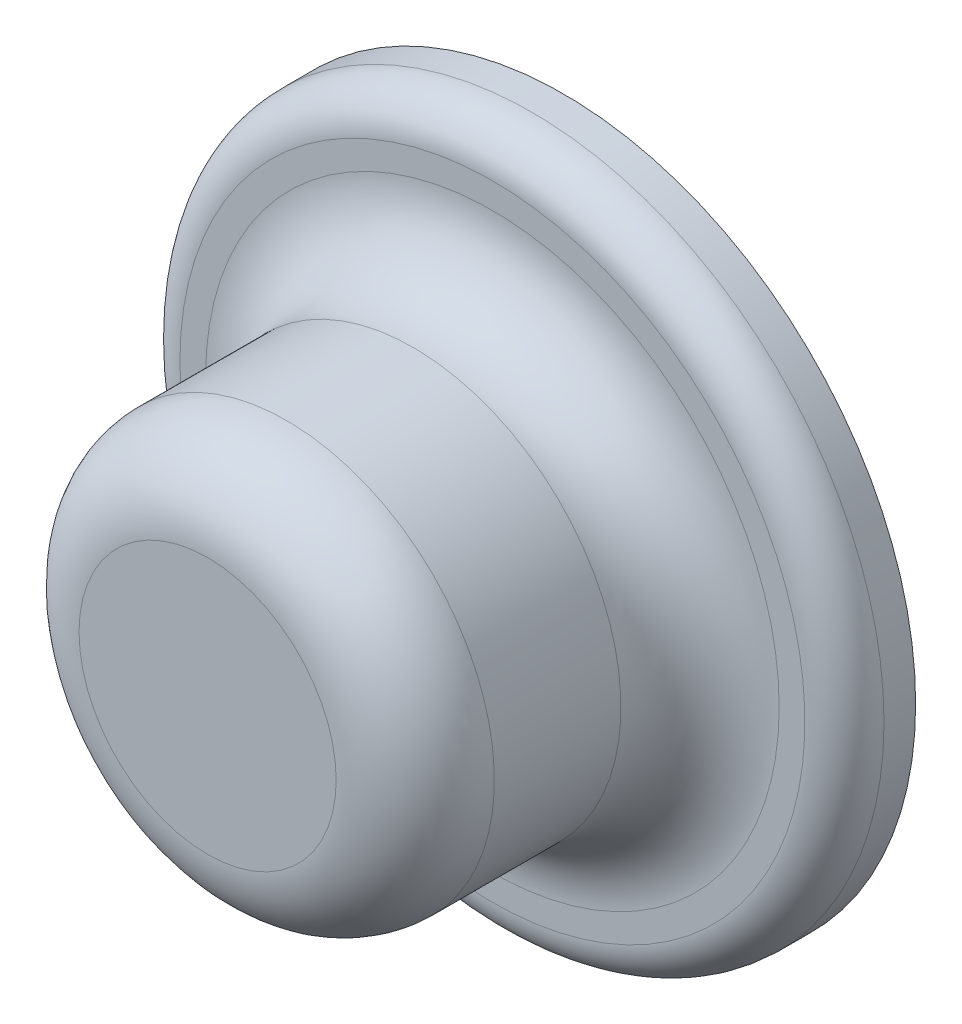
from build123d import *


with BuildPart() as part:
    # Esquisse3 → R_volution1 (revolve)
    with BuildSketch(Plane(origin=(0, 0, 0), x_dir=(-1, 0, 0), z_dir=(0, 1, 0))):
        with BuildLine():
            Line((89, 70), (60, 70))
            Line((60, 70), (60, 82))
            Line((60, 82), (43, 82))
            Line((43, 82), (43, 103))
            Line((43, 103), (37.5, 103))
            Line((37.5, 103), (37.5, 130))
            ThreePointArc((37.5, 130), (34.571067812, 137.071067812), (27.5, 140))
            Line((27.5, 140), (0, 140))
            Line((0, 140), (0, 160))
            Line((0, 160), (32.5, 160))
            ThreePointArc((32.5, 160), (46.642135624, 154.142135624), (52.5, 140))
            Line((52.5, 140), (52.5, 107.998633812))
            ThreePointArc((52.5, 107.998633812), (58.357864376, 93.856498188), (72.5, 87.998633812))
            Line((72.5, 87.998633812), (79, 87.998633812))
            ThreePointArc((79, 87.998633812), (86.071067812, 85.069701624), (89, 77.998633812))
            Line((89, 77.998633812), (89, 70))
        make_face()
    revolve(axis=Axis((0, 0, 48.538917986), (0, 0, 1)))


solid = part.part
